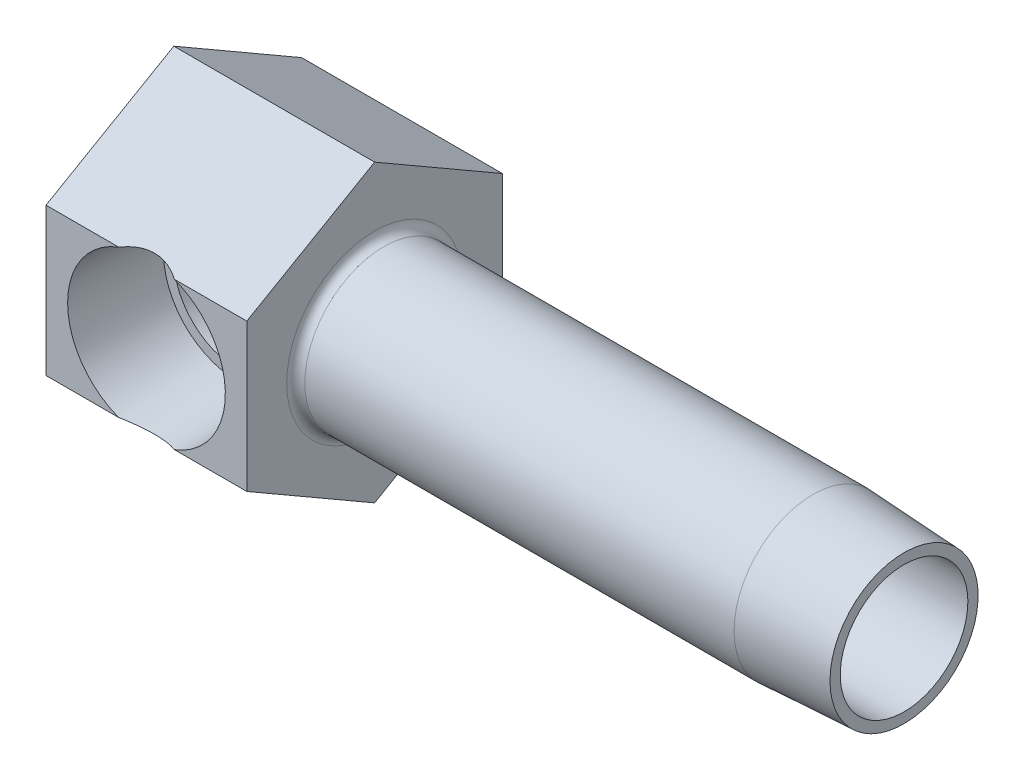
ISO-10303-21;
HEADER;
FILE_DESCRIPTION(('STEP AP214'),'2;1');
FILE_NAME('part.step','',(''),(''),'','','');
FILE_SCHEMA(('AUTOMOTIVE_DESIGN { 1 0 10303 214 1 1 1 1 }'));
ENDSEC;
DATA;
#1=APPLICATION_CONTEXT('core data for automotive mechanical design processes');
#2=APPLICATION_PROTOCOL_DEFINITION('international standard','automotive_design',2000,#1);
#3=PRODUCT_CONTEXT('',#1,'mechanical');
#4=PRODUCT('Part','Part','',(#3));
#5=PRODUCT_RELATED_PRODUCT_CATEGORY('part','',(#4));
#6=PRODUCT_DEFINITION_FORMATION('','',#4);
#7=PRODUCT_DEFINITION_CONTEXT('part definition',#1,'design');
#8=PRODUCT_DEFINITION('design','',#6,#7);
#9=PRODUCT_DEFINITION_SHAPE('','',#8);
#10=(LENGTH_UNIT() NAMED_UNIT(*) SI_UNIT(.MILLI.,.METRE.));
#11=(NAMED_UNIT(*) PLANE_ANGLE_UNIT() SI_UNIT($,.RADIAN.));
#12=(NAMED_UNIT(*) SI_UNIT($,.STERADIAN.) SOLID_ANGLE_UNIT());
#13=UNCERTAINTY_MEASURE_WITH_UNIT(LENGTH_MEASURE(1.E-05),#10,'distance_accuracy_value','');
#14=(GEOMETRIC_REPRESENTATION_CONTEXT(3) GLOBAL_UNCERTAINTY_ASSIGNED_CONTEXT((#13)) GLOBAL_UNIT_ASSIGNED_CONTEXT((#10,
#11,#12)) REPRESENTATION_CONTEXT('',''));
#15=CARTESIAN_POINT('',(0.,0.,0.));
#16=DIRECTION('',(0.,0.,1.));
#17=DIRECTION('',(1.,0.,0.));
#18=AXIS2_PLACEMENT_3D('',#15,#16,#17);
#19=CARTESIAN_POINT('',(8.7376,0.,22.225));
#20=DIRECTION('',(0.,0.,1.));
#21=DIRECTION('',(1.,0.,0.));
#22=AXIS2_PLACEMENT_3D('',#19,#20,#21);
#23=CONICAL_SURFACE('',#22,6.858,0.0523598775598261);
#24=CARTESIAN_POINT('',(8.7376,-0.680996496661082,34.5170205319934));
#25=DIRECTION('',(0.,-0.866025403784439,-0.5));
#26=DIRECTION('',(0.,-0.5,0.866025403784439));
#27=AXIS2_PLACEMENT_3D('',#24,#25,#26);
#28=ELLIPSE('',#27,15.0043949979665,7.47122554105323);
#29=CARTESIAN_POINT('',(11.1603281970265,6.4158048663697,22.225));
#30=VERTEX_POINT('',#29);
#31=CARTESIAN_POINT('',(6.3148718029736,6.4158048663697,22.225));
#32=VERTEX_POINT('',#31);
#33=EDGE_CURVE('E216',#30,#32,#28,.F.);
#34=ORIENTED_EDGE('',*,*,#33,.T.);
#35=CARTESIAN_POINT('',(8.7376,0.,22.225));
#36=DIRECTION('',(0.,0.,-1.));
#37=DIRECTION('',(-1.,0.,0.));
#38=AXIS2_PLACEMENT_3D('',#35,#36,#37);
#39=CIRCLE('',#38,6.858);
#40=CARTESIAN_POINT('',(6.31487180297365,-6.41580486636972,22.225));
#41=VERTEX_POINT('',#40);
#42=EDGE_CURVE('E38',#41,#32,#39,.T.);
#43=ORIENTED_EDGE('',*,*,#42,.F.);
#44=CARTESIAN_POINT('',(8.7376,0.680996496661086,34.5170205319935));
#45=DIRECTION('',(0.,0.866025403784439,-0.5));
#46=DIRECTION('',(0.,0.5,0.866025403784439));
#47=AXIS2_PLACEMENT_3D('',#44,#45,#46);
#48=ELLIPSE('',#47,15.0043949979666,7.47122554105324);
#49=CARTESIAN_POINT('',(11.1603281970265,-6.4158048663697,22.225));
#50=VERTEX_POINT('',#49);
#51=EDGE_CURVE('E23',#41,#50,#48,.F.);
#52=ORIENTED_EDGE('',*,*,#51,.T.);
#53=EDGE_CURVE('E220',#30,#50,#39,.T.);
#54=ORIENTED_EDGE('',*,*,#53,.F.);
#55=EDGE_LOOP('',(#34,#43,#52,#54));
#56=FACE_BOUND('',#55,.T.);
#57=CARTESIAN_POINT('',(8.7376,0.,14.3002));
#58=DIRECTION('',(0.,0.,-1.));
#59=DIRECTION('',(-1.,0.,0.));
#60=AXIS2_PLACEMENT_3D('',#57,#58,#59);
#61=CIRCLE('',#60,6.44267883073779);
#62=CARTESIAN_POINT('',(13.3057672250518,-4.54312213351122,14.3002));
#63=VERTEX_POINT('',#62);
#64=CARTESIAN_POINT('',(13.3057672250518,4.54312213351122,14.3002));
#65=VERTEX_POINT('',#64);
#66=EDGE_CURVE('E219',#63,#65,#61,.T.);
#67=ORIENTED_EDGE('',*,*,#66,.T.);
#68=CARTESIAN_POINT('',(13.3056128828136,4.54326245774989,14.3));
#69=CARTESIAN_POINT('',(13.4050037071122,4.45290836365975,14.4287190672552));
#70=CARTESIAN_POINT('',(13.5038252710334,4.35690222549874,14.5539811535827));
#71=CARTESIAN_POINT('',(13.6989301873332,4.15324987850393,14.7972290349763));
#72=CARTESIAN_POINT('',(13.7952093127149,4.04558563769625,14.9152031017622));
#73=CARTESIAN_POINT('',(13.9843700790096,3.81752411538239,15.1441485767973));
#74=CARTESIAN_POINT('',(14.0772125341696,3.69701926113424,15.25504596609));
#75=CARTESIAN_POINT('',(14.2568464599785,3.44414434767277,15.4675620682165));
#76=CARTESIAN_POINT('',(14.3436418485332,3.31178210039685,15.5691868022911));
#77=CARTESIAN_POINT('',(14.5527686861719,2.962976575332,15.8122617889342));
#78=CARTESIAN_POINT('',(14.6701286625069,2.73858307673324,15.9469651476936));
#79=CARTESIAN_POINT('',(14.8276174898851,2.38307262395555,16.1264780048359));
#80=CARTESIAN_POINT('',(14.8769849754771,2.2615363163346,16.1825173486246));
#81=CARTESIAN_POINT('',(14.9687772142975,2.0125151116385,16.2864098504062));
#82=CARTESIAN_POINT('',(15.0112056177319,1.88503338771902,16.3342673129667));
#83=CARTESIAN_POINT('',(15.088733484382,1.6232487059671,16.4215218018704));
#84=CARTESIAN_POINT('',(15.1237419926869,1.48888366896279,16.4608139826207));
#85=CARTESIAN_POINT('',(15.1849785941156,1.21573970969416,16.5294343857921));
#86=CARTESIAN_POINT('',(15.2112114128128,1.0769632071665,16.5587679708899));
#87=CARTESIAN_POINT('',(15.2542466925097,0.796159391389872,16.6068431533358));
#88=CARTESIAN_POINT('',(15.2710505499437,0.654132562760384,16.6255863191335));
#89=CARTESIAN_POINT('',(15.2947665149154,0.368243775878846,16.6520290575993));
#90=CARTESIAN_POINT('',(15.3016803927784,0.22438215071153,16.6597306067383));
#91=CARTESIAN_POINT('',(15.3051381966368,-0.0413792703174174,16.6635827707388));
#92=CARTESIAN_POINT('',(15.3031178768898,-0.163241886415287,16.6613326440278));
#93=CARTESIAN_POINT('',(15.2919140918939,-0.406265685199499,16.6488476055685));
#94=CARTESIAN_POINT('',(15.282728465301,-0.527426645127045,16.6386102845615));
#95=CARTESIAN_POINT('',(15.2573805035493,-0.768029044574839,16.6103343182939));
#96=CARTESIAN_POINT('',(15.2412218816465,-0.88747136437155,16.5922998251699));
#97=CARTESIAN_POINT('',(15.2022471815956,-1.1238947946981,16.5487418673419));
#98=CARTESIAN_POINT('',(15.1794285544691,-1.24087494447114,16.5232155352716));
#99=CARTESIAN_POINT('',(15.1030013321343,-1.58064044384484,16.4375716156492));
#100=CARTESIAN_POINT('',(15.0406598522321,-1.79907617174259,16.3675454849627));
#101=CARTESIAN_POINT('',(14.8959772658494,-2.2198653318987,16.2041288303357));
#102=CARTESIAN_POINT('',(14.8136249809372,-2.42220969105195,16.1107252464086));
#103=CARTESIAN_POINT('',(14.6581620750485,-2.75475802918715,15.9330467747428));
#104=CARTESIAN_POINT('',(14.588877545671,-2.88934500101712,15.8534887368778));
#105=CARTESIAN_POINT('',(14.4433958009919,-3.14876465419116,15.6853070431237));
#106=CARTESIAN_POINT('',(14.3671982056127,-3.27359679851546,15.5966828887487));
#107=CARTESIAN_POINT('',(14.2091096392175,-3.51355050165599,15.4112660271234));
#108=CARTESIAN_POINT('',(14.1272094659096,-3.62865566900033,15.3144600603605));
#109=CARTESIAN_POINT('',(13.9591121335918,-3.84892561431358,15.1136697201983));
#110=CARTESIAN_POINT('',(13.8729164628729,-3.95409379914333,15.0096878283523));
#111=CARTESIAN_POINT('',(13.7069469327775,-4.14374167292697,14.806812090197));
#112=CARTESIAN_POINT('',(13.62749258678,-4.22922772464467,14.7085925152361));
#113=CARTESIAN_POINT('',(13.4673498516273,-4.39212627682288,14.5076746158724));
#114=CARTESIAN_POINT('',(13.386669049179,-4.46957495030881,14.404999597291));
#115=CARTESIAN_POINT('',(13.3056128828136,-4.54326245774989,14.3));
#116=B_SPLINE_CURVE_WITH_KNOTS('',3,(#68,#69,#70,#71,#72,#73,#74,#75,#76,#77,#78,#79,#80,#81,
#82,#83,#84,#85,#86,#87,#88,#89,#90,#91,#92,#93,#94,#95,#96,#97,#98,#99,#100,#101,#102,#103,
#104,#105,#106,#107,#108,#109,#110,#111,#112,#113,#114,#115),.UNSPECIFIED.,.F.,.F.,(4,2,2,2,2,2,
2,2,2,2,2,2,2,2,2,2,2,2,2,2,2,2,2,4),(0.,0.55807217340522,1.11702021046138,1.68108674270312,
2.24478434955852,3.10140634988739,3.52893103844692,3.95623010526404,4.38849766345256,
4.82053207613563,5.25250248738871,5.68439556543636,6.04963287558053,6.41498039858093,
6.78013360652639,7.14542675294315,7.85550743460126,8.56598569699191,9.07835413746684,
9.59075076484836,10.1039943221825,10.6170612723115,11.0743952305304,11.5295724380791),.UNSPECIFIED.);
#117=EDGE_CURVE('E131',#65,#63,#116,.T.);
#118=ORIENTED_EDGE('',*,*,#117,.T.);
#119=EDGE_LOOP('',(#67,#118));
#120=FACE_BOUND('',#119,.T.);
#121=ADVANCED_FACE('F15',(#56,#120),#23,.F.);
#122=CARTESIAN_POINT('',(15.1802788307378,0.,14.3002));
#123=DIRECTION('',(0.,0.,1.));
#124=DIRECTION('',(1.,0.,0.));
#125=AXIS2_PLACEMENT_3D('',#122,#123,#124);
#126=PLANE('',#125);
#127=ORIENTED_EDGE('',*,*,#66,.F.);
#128=DIRECTION('',(1.,0.,0.));
#129=VECTOR('',#128,1.);
#130=CARTESIAN_POINT('',(65.6255637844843,-4.54312213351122,14.3002));
#131=LINE('',#130,#129);
#132=CARTESIAN_POINT('',(11.9253,-4.54312213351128,14.3002));
#133=VERTEX_POINT('',#132);
#134=EDGE_CURVE('E129',#63,#133,#131,.F.);
#135=ORIENTED_EDGE('',*,*,#134,.T.);
#136=CARTESIAN_POINT('',(8.7376,0.,14.3002));
#137=DIRECTION('',(0.,0.,-1.));
#138=DIRECTION('',(-1.,0.,0.));
#139=AXIS2_PLACEMENT_3D('',#136,#137,#138);
#140=CIRCLE('',#139,5.5499);
#141=CARTESIAN_POINT('',(11.9253,4.54312213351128,14.3002));
#142=VERTEX_POINT('',#141);
#143=EDGE_CURVE('E121',#133,#142,#140,.T.);
#144=ORIENTED_EDGE('',*,*,#143,.T.);
#145=DIRECTION('',(1.,0.,0.));
#146=VECTOR('',#145,1.);
#147=CARTESIAN_POINT('',(65.6255637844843,4.54312213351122,14.3002));
#148=LINE('',#147,#146);
#149=EDGE_CURVE('E124',#142,#65,#148,.T.);
#150=ORIENTED_EDGE('',*,*,#149,.T.);
#151=EDGE_LOOP('',(#127,#135,#144,#150));
#152=FACE_BOUND('',#151,.T.);
#153=ADVANCED_FACE('F159',(#152),#126,.T.);
#154=CARTESIAN_POINT('',(8.7376,0.,27.6280516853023));
#155=DIRECTION('',(0.,0.,-1.));
#156=DIRECTION('',(-1.,0.,0.));
#157=AXIS2_PLACEMENT_3D('',#154,#155,#156);
#158=CYLINDRICAL_SURFACE('',#157,5.5499);
#159=ORIENTED_EDGE('',*,*,#143,.F.);
#160=CARTESIAN_POINT('',(8.7376,0.,11.1125));
#161=DIRECTION('',(0.707106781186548,0.,-0.707106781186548));
#162=DIRECTION('',(-0.707106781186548,0.,-0.707106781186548));
#163=AXIS2_PLACEMENT_3D('',#160,#161,#162);
#164=ELLIPSE('',#163,7.84874384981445,5.5499);
#165=CARTESIAN_POINT('',(8.7376,-5.5499,11.1125));
#166=VERTEX_POINT('',#165);
#167=EDGE_CURVE('E110',#133,#166,#164,.T.);
#168=ORIENTED_EDGE('',*,*,#167,.T.);
#169=CARTESIAN_POINT('',(8.7376,0.,11.1125));
#170=DIRECTION('',(-0.707106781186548,0.,-0.707106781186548));
#171=DIRECTION('',(0.707106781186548,0.,-0.707106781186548));
#172=AXIS2_PLACEMENT_3D('',#169,#170,#171);
#173=ELLIPSE('',#172,7.84874384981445,5.5499);
#174=CARTESIAN_POINT('',(13.4708637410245,-2.89786203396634,6.37923625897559));
#175=VERTEX_POINT('',#174);
#176=EDGE_CURVE('E106',#166,#175,#173,.F.);
#177=ORIENTED_EDGE('',*,*,#176,.T.);
#178=CARTESIAN_POINT('',(8.7376,0.,6.37923625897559));
#179=DIRECTION('',(0.,0.,-1.));
#180=DIRECTION('',(-1.,0.,0.));
#181=AXIS2_PLACEMENT_3D('',#178,#179,#180);
#182=CIRCLE('',#181,5.5499);
#183=CARTESIAN_POINT('',(13.4708637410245,2.89786203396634,6.37923625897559));
#184=VERTEX_POINT('',#183);
#185=EDGE_CURVE('E223',#175,#184,#182,.T.);
#186=ORIENTED_EDGE('',*,*,#185,.T.);
#187=CARTESIAN_POINT('',(8.7376,5.5499,11.1125));
#188=VERTEX_POINT('',#187);
#189=EDGE_CURVE('E30',#184,#188,#173,.F.);
#190=ORIENTED_EDGE('',*,*,#189,.T.);
#191=EDGE_CURVE('E122',#188,#142,#164,.T.);
#192=ORIENTED_EDGE('',*,*,#191,.T.);
#193=EDGE_LOOP('',(#159,#168,#177,#186,#190,#192));
#194=FACE_BOUND('',#193,.T.);
#195=ADVANCED_FACE('F118',(#194),#158,.F.);
#196=CARTESIAN_POINT('',(8.7376,0.,6.37923625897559));
#197=DIRECTION('',(0.,0.,1.));
#198=DIRECTION('',(1.,0.,0.));
#199=AXIS2_PLACEMENT_3D('',#196,#197,#198);
#200=CONICAL_SURFACE('',#199,5.5499,1.04719755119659);
#201=CARTESIAN_POINT('',(8.7376,0.,3.175));
#202=VERTEX_POINT('',#201);
#203=VERTEX_LOOP('',#202);
#204=FACE_BOUND('',#203,.T.);
#205=ORIENTED_EDGE('',*,*,#185,.F.);
#206=CARTESIAN_POINT('',(13.4710699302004,-2.89818868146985,6.37943625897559));
#207=CARTESIAN_POINT('',(13.420685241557,-2.8185279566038,6.33063423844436));
#208=CARTESIAN_POINT('',(13.3737513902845,-2.73601453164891,6.2828976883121));
#209=CARTESIAN_POINT('',(13.2869939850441,-2.56583570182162,6.19038737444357));
#210=CARTESIAN_POINT('',(13.2471660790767,-2.47817349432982,6.14561180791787));
#211=CARTESIAN_POINT('',(13.1751547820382,-2.29911606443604,6.06025322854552));
#212=CARTESIAN_POINT('',(13.1428940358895,-2.20777091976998,6.01963042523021));
#213=CARTESIAN_POINT('',(13.0851463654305,-2.02119544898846,5.94274790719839));
#214=CARTESIAN_POINT('',(13.0596596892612,-1.92596498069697,5.90648835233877));
#215=CARTESIAN_POINT('',(13.0148514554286,-1.73255643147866,5.83897057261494));
#216=CARTESIAN_POINT('',(12.9955185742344,-1.63438413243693,5.80770321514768));
#217=CARTESIAN_POINT('',(12.9620830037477,-1.4356334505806,5.75050007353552));
#218=CARTESIAN_POINT('',(12.9479806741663,-1.33505490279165,5.72456465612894));
#219=CARTESIAN_POINT('',(12.9240526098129,-1.13183172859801,5.67823452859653));
#220=CARTESIAN_POINT('',(12.9142392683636,-1.0291819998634,5.65785593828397));
#221=CARTESIAN_POINT('',(12.8981074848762,-0.822623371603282,5.62290462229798));
#222=CARTESIAN_POINT('',(12.891789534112,-0.718714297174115,5.60833271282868));
#223=CARTESIAN_POINT('',(12.8810293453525,-0.489671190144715,5.58281999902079));
#224=CARTESIAN_POINT('',(12.8771967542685,-0.364365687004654,5.57314917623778));
#225=CARTESIAN_POINT('',(12.8729275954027,-0.113319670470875,5.56233429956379));
#226=CARTESIAN_POINT('',(12.8724915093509,0.0124209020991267,5.56119145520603));
#227=CARTESIAN_POINT('',(12.874939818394,0.263686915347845,5.567443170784));
#228=CARTESIAN_POINT('',(12.8778249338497,0.389212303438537,5.57483958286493));
#229=CARTESIAN_POINT('',(12.8874191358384,0.639322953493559,5.59811647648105));
#230=CARTESIAN_POINT('',(12.8941278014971,0.763908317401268,5.61399602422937));
#231=CARTESIAN_POINT('',(12.9116197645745,1.00072761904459,5.65236645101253));
#232=CARTESIAN_POINT('',(12.9220027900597,1.11310193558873,5.6741708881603));
#233=CARTESIAN_POINT('',(12.9479188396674,1.33574469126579,5.72453194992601));
#234=CARTESIAN_POINT('',(12.9634519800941,1.44601308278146,5.75308872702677));
#235=CARTESIAN_POINT('',(13.00082798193,1.66326683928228,5.81649299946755));
#236=CARTESIAN_POINT('',(13.022650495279,1.77026157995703,5.85132007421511));
#237=CARTESIAN_POINT('',(13.0737132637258,1.98033019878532,5.92673676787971));
#238=CARTESIAN_POINT('',(13.1029503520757,2.08340572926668,5.96732392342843));
#239=CARTESIAN_POINT('',(13.1785970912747,2.31167706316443,6.06504898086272));
#240=CARTESIAN_POINT('',(13.2275080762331,2.43541928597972,6.12371071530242));
#241=CARTESIAN_POINT('',(13.3111431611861,2.61414296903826,6.21635789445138));
#242=CARTESIAN_POINT('',(13.3408272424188,2.67271819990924,6.24810824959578));
#243=CARTESIAN_POINT('',(13.4034989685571,2.78735967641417,6.31288069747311));
#244=CARTESIAN_POINT('',(13.4364871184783,2.8434255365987,6.34590298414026));
#245=CARTESIAN_POINT('',(13.4710699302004,2.89818868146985,6.37943625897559));
#246=B_SPLINE_CURVE_WITH_KNOTS('',3,(#206,#207,#208,#209,#210,#211,#212,#213,#214,#215,#216,
#217,#218,#219,#220,#221,#222,#223,#224,#225,#226,#227,#228,#229,#230,#231,#232,#233,#234,#235,
#236,#237,#238,#239,#240,#241,#242,#243,#244,#245),.UNSPECIFIED.,.F.,.F.,(4,2,2,2,2,2,2,2,2,2,2,
2,2,2,2,2,2,2,2,4),(0.,0.318348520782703,0.636501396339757,0.951244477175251,1.26599908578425,
1.58017112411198,1.89436476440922,2.20946038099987,2.52460027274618,2.90145665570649,
3.27836648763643,3.65535808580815,4.03230819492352,4.37682355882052,4.72134670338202,
5.06476748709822,5.40804184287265,5.84309066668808,6.06180090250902,6.28054461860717),.UNSPECIFIED.);
#247=EDGE_CURVE('E112',#175,#184,#246,.T.);
#248=ORIENTED_EDGE('',*,*,#247,.T.);
#249=EDGE_LOOP('',(#205,#248));
#250=FACE_BOUND('',#249,.T.);
#251=ADVANCED_FACE('F151',(#204,#250),#200,.F.);
#252=CARTESIAN_POINT('',(63.5,0.,11.1125));
#253=DIRECTION('',(-1.,0.,0.));
#254=DIRECTION('',(0.,0.,1.));
#255=AXIS2_PLACEMENT_3D('',#252,#253,#254);
#256=PLANE('',#255);
#257=CARTESIAN_POINT('',(63.5,0.,11.1125));
#258=DIRECTION('',(-1.,0.,0.));
#259=DIRECTION('',(0.,0.,1.));
#260=AXIS2_PLACEMENT_3D('',#257,#258,#259);
#261=CIRCLE('',#260,6.44267883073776);
#262=CARTESIAN_POINT('',(63.5,0.,17.5551788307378));
#263=VERTEX_POINT('',#262);
#264=EDGE_CURVE('E10',#263,#263,#261,.F.);
#265=ORIENTED_EDGE('',*,*,#264,.T.);
#266=EDGE_LOOP('',(#265));
#267=FACE_BOUND('',#266,.T.);
#268=CARTESIAN_POINT('',(63.5,0.,11.1125));
#269=DIRECTION('',(1.,0.,0.));
#270=DIRECTION('',(0.,0.,-1.));
#271=AXIS2_PLACEMENT_3D('',#268,#269,#270);
#272=CIRCLE('',#271,5.5499);
#273=CARTESIAN_POINT('',(63.5,0.,5.5626));
#274=VERTEX_POINT('',#273);
#275=EDGE_CURVE('E150',#274,#274,#272,.T.);
#276=ORIENTED_EDGE('',*,*,#275,.F.);
#277=EDGE_LOOP('',(#276));
#278=FACE_BOUND('',#277,.T.);
#279=ADVANCED_FACE('F155',(#267,#278),#256,.F.);
#280=CARTESIAN_POINT('',(17.4625,12.8316097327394,11.1125));
#281=DIRECTION('',(0.,-0.866025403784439,-0.5));
#282=DIRECTION('',(0.,0.5,-0.866025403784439));
#283=AXIS2_PLACEMENT_3D('',#280,#281,#282);
#284=PLANE('',#283);
#285=ORIENTED_EDGE('',*,*,#33,.F.);
#286=DIRECTION('',(-1.,0.,0.));
#287=VECTOR('',#286,1.);
#288=CARTESIAN_POINT('',(17.4625,6.4158048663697,22.225));
#289=LINE('',#288,#287);
#290=CARTESIAN_POINT('',(17.4625,6.4158048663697,22.225));
#291=VERTEX_POINT('',#290);
#292=EDGE_CURVE('E268',#291,#30,#289,.T.);
#293=ORIENTED_EDGE('',*,*,#292,.F.);
#294=DIRECTION('',(0.,-0.5,0.866025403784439));
#295=VECTOR('',#294,1.);
#296=CARTESIAN_POINT('',(17.4625,12.8316097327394,11.1125));
#297=LINE('',#296,#295);
#298=CARTESIAN_POINT('',(17.4625,12.8316097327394,11.1125));
#299=VERTEX_POINT('',#298);
#300=EDGE_CURVE('E252',#299,#291,#297,.T.);
#301=ORIENTED_EDGE('',*,*,#300,.F.);
#302=DIRECTION('',(-1.,0.,0.));
#303=VECTOR('',#302,1.);
#304=CARTESIAN_POINT('',(17.4625,12.8316097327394,11.1125));
#305=LINE('',#304,#303);
#306=CARTESIAN_POINT('',(0.,12.8316097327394,11.1125));
#307=VERTEX_POINT('',#306);
#308=EDGE_CURVE('E271',#299,#307,#305,.T.);
#309=ORIENTED_EDGE('',*,*,#308,.T.);
#310=DIRECTION('',(0.,-0.5,0.866025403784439));
#311=VECTOR('',#310,1.);
#312=CARTESIAN_POINT('',(0.,12.8316097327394,11.1125));
#313=LINE('',#312,#311);
#314=CARTESIAN_POINT('',(0.,6.4158048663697,22.225));
#315=VERTEX_POINT('',#314);
#316=EDGE_CURVE('E234',#307,#315,#313,.T.);
#317=ORIENTED_EDGE('',*,*,#316,.T.);
#318=EDGE_CURVE('E267',#32,#315,#289,.T.);
#319=ORIENTED_EDGE('',*,*,#318,.F.);
#320=EDGE_LOOP('',(#285,#293,#301,#309,#317,#319));
#321=FACE_BOUND('',#320,.T.);
#322=ADVANCED_FACE('F170',(#321),#284,.F.);
#323=CARTESIAN_POINT('',(17.4625,6.4158048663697,22.225));
#324=DIRECTION('',(0.,0.,-1.));
#325=DIRECTION('',(0.,1.,0.));
#326=AXIS2_PLACEMENT_3D('',#323,#324,#325);
#327=PLANE('',#326);
#328=ORIENTED_EDGE('',*,*,#42,.T.);
#329=ORIENTED_EDGE('',*,*,#318,.T.);
#330=DIRECTION('',(0.,-1.,0.));
#331=VECTOR('',#330,1.);
#332=CARTESIAN_POINT('',(0.,6.4158048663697,22.225));
#333=LINE('',#332,#331);
#334=CARTESIAN_POINT('',(0.,-6.41580486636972,22.225));
#335=VERTEX_POINT('',#334);
#336=EDGE_CURVE('E238',#315,#335,#333,.T.);
#337=ORIENTED_EDGE('',*,*,#336,.T.);
#338=DIRECTION('',(-1.,0.,0.));
#339=VECTOR('',#338,1.);
#340=CARTESIAN_POINT('',(17.4625,-6.41580486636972,22.225));
#341=LINE('',#340,#339);
#342=EDGE_CURVE('E263',#41,#335,#341,.T.);
#343=ORIENTED_EDGE('',*,*,#342,.F.);
#344=EDGE_LOOP('',(#328,#329,#337,#343));
#345=FACE_BOUND('',#344,.T.);
#346=ADVANCED_FACE('F190',(#345),#327,.F.);
#347=ORIENTED_EDGE('',*,*,#53,.T.);
#348=CARTESIAN_POINT('',(17.4625,-6.41580486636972,22.225));
#349=VERTEX_POINT('',#348);
#350=EDGE_CURVE('E264',#349,#50,#341,.T.);
#351=ORIENTED_EDGE('',*,*,#350,.F.);
#352=DIRECTION('',(0.,-1.,0.));
#353=VECTOR('',#352,1.);
#354=CARTESIAN_POINT('',(17.4625,6.4158048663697,22.225));
#355=LINE('',#354,#353);
#356=EDGE_CURVE('E254',#291,#349,#355,.T.);
#357=ORIENTED_EDGE('',*,*,#356,.F.);
#358=ORIENTED_EDGE('',*,*,#292,.T.);
#359=EDGE_LOOP('',(#347,#351,#357,#358));
#360=FACE_BOUND('',#359,.T.);
#361=ADVANCED_FACE('F188',(#360),#327,.F.);
#362=CARTESIAN_POINT('',(17.4625,-6.41580486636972,22.225));
#363=DIRECTION('',(0.,0.866025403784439,-0.5));
#364=DIRECTION('',(0.,0.5,0.866025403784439));
#365=AXIS2_PLACEMENT_3D('',#362,#363,#364);
#366=PLANE('',#365);
#367=ORIENTED_EDGE('',*,*,#51,.F.);
#368=ORIENTED_EDGE('',*,*,#342,.T.);
#369=DIRECTION('',(0.,-0.5,-0.866025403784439));
#370=VECTOR('',#369,1.);
#371=CARTESIAN_POINT('',(0.,-6.41580486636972,22.225));
#372=LINE('',#371,#370);
#373=CARTESIAN_POINT('',(0.,-12.8316097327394,11.1125));
#374=VERTEX_POINT('',#373);
#375=EDGE_CURVE('E242',#335,#374,#372,.T.);
#376=ORIENTED_EDGE('',*,*,#375,.T.);
#377=DIRECTION('',(-1.,0.,0.));
#378=VECTOR('',#377,1.);
#379=CARTESIAN_POINT('',(17.4625,-12.8316097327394,11.1125));
#380=LINE('',#379,#378);
#381=CARTESIAN_POINT('',(17.4625,-12.8316097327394,11.1125));
#382=VERTEX_POINT('',#381);
#383=EDGE_CURVE('E258',#382,#374,#380,.T.);
#384=ORIENTED_EDGE('',*,*,#383,.F.);
#385=DIRECTION('',(0.,-0.5,-0.866025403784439));
#386=VECTOR('',#385,1.);
#387=CARTESIAN_POINT('',(17.4625,-6.41580486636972,22.225));
#388=LINE('',#387,#386);
#389=EDGE_CURVE('E256',#349,#382,#388,.T.);
#390=ORIENTED_EDGE('',*,*,#389,.F.);
#391=ORIENTED_EDGE('',*,*,#350,.T.);
#392=EDGE_LOOP('',(#367,#368,#376,#384,#390,#391));
#393=FACE_BOUND('',#392,.T.);
#394=ADVANCED_FACE('F184',(#393),#366,.F.);
#395=CARTESIAN_POINT('',(17.4625,-12.8316097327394,11.1125));
#396=DIRECTION('',(0.,0.866025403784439,0.5));
#397=DIRECTION('',(0.,-0.5,0.866025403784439));
#398=AXIS2_PLACEMENT_3D('',#395,#396,#397);
#399=PLANE('',#398);
#400=DIRECTION('',(0.,0.5,-0.866025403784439));
#401=VECTOR('',#400,1.);
#402=CARTESIAN_POINT('',(0.,-12.8316097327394,11.1125));
#403=LINE('',#402,#401);
#404=CARTESIAN_POINT('',(0.,-6.41580486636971,0.));
#405=VERTEX_POINT('',#404);
#406=EDGE_CURVE('E227',#374,#405,#403,.T.);
#407=ORIENTED_EDGE('',*,*,#406,.T.);
#408=DIRECTION('',(-1.,0.,0.));
#409=VECTOR('',#408,1.);
#410=CARTESIAN_POINT('',(17.4625,-6.41580486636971,0.));
#411=LINE('',#410,#409);
#412=CARTESIAN_POINT('',(17.4625,-6.41580486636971,0.));
#413=VERTEX_POINT('',#412);
#414=EDGE_CURVE('E277',#413,#405,#411,.T.);
#415=ORIENTED_EDGE('',*,*,#414,.F.);
#416=DIRECTION('',(0.,0.5,-0.866025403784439));
#417=VECTOR('',#416,1.);
#418=CARTESIAN_POINT('',(17.4625,-12.8316097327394,11.1125));
#419=LINE('',#418,#417);
#420=EDGE_CURVE('E245',#382,#413,#419,.T.);
#421=ORIENTED_EDGE('',*,*,#420,.F.);
#422=ORIENTED_EDGE('',*,*,#383,.T.);
#423=EDGE_LOOP('',(#407,#415,#421,#422));
#424=FACE_BOUND('',#423,.T.);
#425=ADVANCED_FACE('F187',(#424),#399,.F.);
#426=CARTESIAN_POINT('',(17.4625,-6.41580486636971,0.));
#427=DIRECTION('',(0.,0.,1.));
#428=DIRECTION('',(1.,0.,0.));
#429=AXIS2_PLACEMENT_3D('',#426,#427,#428);
#430=PLANE('',#429);
#431=DIRECTION('',(0.,1.,0.));
#432=VECTOR('',#431,1.);
#433=CARTESIAN_POINT('',(0.,-6.41580486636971,0.));
#434=LINE('',#433,#432);
#435=CARTESIAN_POINT('',(0.,6.41580486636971,0.));
#436=VERTEX_POINT('',#435);
#437=EDGE_CURVE('E228',#405,#436,#434,.T.);
#438=ORIENTED_EDGE('',*,*,#437,.T.);
#439=DIRECTION('',(-1.,0.,0.));
#440=VECTOR('',#439,1.);
#441=CARTESIAN_POINT('',(17.4625,6.41580486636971,0.));
#442=LINE('',#441,#440);
#443=CARTESIAN_POINT('',(17.4625,6.41580486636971,0.));
#444=VERTEX_POINT('',#443);
#445=EDGE_CURVE('E274',#444,#436,#442,.T.);
#446=ORIENTED_EDGE('',*,*,#445,.F.);
#447=DIRECTION('',(0.,1.,0.));
#448=VECTOR('',#447,1.);
#449=CARTESIAN_POINT('',(17.4625,-6.41580486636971,0.));
#450=LINE('',#449,#448);
#451=EDGE_CURVE('E248',#413,#444,#450,.T.);
#452=ORIENTED_EDGE('',*,*,#451,.F.);
#453=ORIENTED_EDGE('',*,*,#414,.T.);
#454=EDGE_LOOP('',(#438,#446,#452,#453));
#455=FACE_BOUND('',#454,.T.);
#456=ADVANCED_FACE('F199',(#455),#430,.F.);
#457=CARTESIAN_POINT('',(17.4625,6.4158048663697,0.));
#458=DIRECTION('',(0.,-0.866025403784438,0.5));
#459=DIRECTION('',(0.,-0.5,-0.866025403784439));
#460=AXIS2_PLACEMENT_3D('',#457,#458,#459);
#461=PLANE('',#460);
#462=DIRECTION('',(0.,0.5,0.866025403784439));
#463=VECTOR('',#462,1.);
#464=CARTESIAN_POINT('',(0.,6.4158048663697,0.));
#465=LINE('',#464,#463);
#466=EDGE_CURVE('E231',#436,#307,#465,.T.);
#467=ORIENTED_EDGE('',*,*,#466,.T.);
#468=ORIENTED_EDGE('',*,*,#308,.F.);
#469=DIRECTION('',(0.,0.5,0.866025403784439));
#470=VECTOR('',#469,1.);
#471=CARTESIAN_POINT('',(17.4625,6.4158048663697,0.));
#472=LINE('',#471,#470);
#473=EDGE_CURVE('E250',#444,#299,#472,.T.);
#474=ORIENTED_EDGE('',*,*,#473,.F.);
#475=ORIENTED_EDGE('',*,*,#445,.T.);
#476=EDGE_LOOP('',(#467,#468,#474,#475));
#477=FACE_BOUND('',#476,.T.);
#478=ADVANCED_FACE('F182',(#477),#461,.F.);
#479=CARTESIAN_POINT('',(17.4625,-19.2474145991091,22.225));
#480=DIRECTION('',(-1.,0.,0.));
#481=DIRECTION('',(0.,-1.,0.));
#482=AXIS2_PLACEMENT_3D('',#479,#480,#481);
#483=PLANE('',#482);
#484=CARTESIAN_POINT('',(17.4625,0.,11.1125));
#485=DIRECTION('',(-1.,0.,0.));
#486=DIRECTION('',(0.,-1.,0.));
#487=AXIS2_PLACEMENT_3D('',#484,#485,#486);
#488=CIRCLE('',#487,7.6454);
#489=CARTESIAN_POINT('',(17.4625,-7.6454,11.1125));
#490=VERTEX_POINT('',#489);
#491=EDGE_CURVE('E280',#490,#490,#488,.T.);
#492=ORIENTED_EDGE('',*,*,#491,.T.);
#493=EDGE_LOOP('',(#492));
#494=FACE_BOUND('',#493,.T.);
#495=ORIENTED_EDGE('',*,*,#420,.T.);
#496=ORIENTED_EDGE('',*,*,#451,.T.);
#497=ORIENTED_EDGE('',*,*,#473,.T.);
#498=ORIENTED_EDGE('',*,*,#300,.T.);
#499=ORIENTED_EDGE('',*,*,#356,.T.);
#500=ORIENTED_EDGE('',*,*,#389,.T.);
#501=EDGE_LOOP('',(#495,#496,#497,#498,#499,#500));
#502=FACE_BOUND('',#501,.T.);
#503=ADVANCED_FACE('F178',(#494,#502),#483,.F.);
#504=CARTESIAN_POINT('',(0.,-19.2474145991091,22.225));
#505=DIRECTION('',(-1.,0.,0.));
#506=DIRECTION('',(0.,-1.,0.));
#507=AXIS2_PLACEMENT_3D('',#504,#505,#506);
#508=PLANE('',#507);
#509=ORIENTED_EDGE('',*,*,#406,.F.);
#510=ORIENTED_EDGE('',*,*,#375,.F.);
#511=ORIENTED_EDGE('',*,*,#336,.F.);
#512=ORIENTED_EDGE('',*,*,#316,.F.);
#513=ORIENTED_EDGE('',*,*,#466,.F.);
#514=ORIENTED_EDGE('',*,*,#437,.F.);
#515=EDGE_LOOP('',(#509,#510,#511,#512,#513,#514));
#516=FACE_BOUND('',#515,.T.);
#517=ADVANCED_FACE('F174',(#516),#508,.T.);
#518=CARTESIAN_POINT('',(63.5,0.,11.1125));
#519=DIRECTION('',(-1.,0.,0.));
#520=DIRECTION('',(0.,0.,1.));
#521=AXIS2_PLACEMENT_3D('',#518,#519,#520);
#522=CYLINDRICAL_SURFACE('',#521,6.858);
#523=CARTESIAN_POINT('',(55.5752,0.,11.1125));
#524=DIRECTION('',(-1.,0.,0.));
#525=DIRECTION('',(0.,0.,1.));
#526=AXIS2_PLACEMENT_3D('',#523,#524,#525);
#527=CIRCLE('',#526,6.858);
#528=CARTESIAN_POINT('',(55.5752,0.,17.9705));
#529=VERTEX_POINT('',#528);
#530=EDGE_CURVE('E137',#529,#529,#527,.F.);
#531=ORIENTED_EDGE('',*,*,#530,.F.);
#532=EDGE_LOOP('',(#531));
#533=FACE_BOUND('',#532,.T.);
#534=CARTESIAN_POINT('',(18.2499,0.,11.1125));
#535=DIRECTION('',(-1.,0.,0.));
#536=DIRECTION('',(0.,-1.,0.));
#537=AXIS2_PLACEMENT_3D('',#534,#535,#536);
#538=CIRCLE('',#537,6.858);
#539=CARTESIAN_POINT('',(18.2499,-6.858,11.1125));
#540=VERTEX_POINT('',#539);
#541=EDGE_CURVE('E283',#540,#540,#538,.F.);
#542=ORIENTED_EDGE('',*,*,#541,.T.);
#543=EDGE_LOOP('',(#542));
#544=FACE_BOUND('',#543,.T.);
#545=ADVANCED_FACE('F166',(#533,#544),#522,.T.);
#546=CARTESIAN_POINT('',(18.2499,0.,11.1125));
#547=DIRECTION('',(-1.,0.,0.));
#548=DIRECTION('',(0.,-1.,0.));
#549=AXIS2_PLACEMENT_3D('',#546,#547,#548);
#550=TOROIDAL_SURFACE('',#549,7.6454,0.7874);
#551=ORIENTED_EDGE('',*,*,#541,.F.);
#552=EDGE_LOOP('',(#551));
#553=FACE_BOUND('',#552,.T.);
#554=ORIENTED_EDGE('',*,*,#491,.F.);
#555=EDGE_LOOP('',(#554));
#556=FACE_BOUND('',#555,.T.);
#557=ADVANCED_FACE('F163',(#553,#556),#550,.F.);
#558=CARTESIAN_POINT('',(63.5029494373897,0.,11.1125));
#559=DIRECTION('',(-1.,0.,0.));
#560=DIRECTION('',(0.,0.,1.));
#561=AXIS2_PLACEMENT_3D('',#558,#559,#560);
#562=CONICAL_SURFACE('',#561,6.44252425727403,0.0523598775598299);
#563=ORIENTED_EDGE('',*,*,#530,.T.);
#564=EDGE_LOOP('',(#563));
#565=FACE_BOUND('',#564,.T.);
#566=ORIENTED_EDGE('',*,*,#264,.F.);
#567=EDGE_LOOP('',(#566));
#568=FACE_BOUND('',#567,.T.);
#569=ADVANCED_FACE('F142',(#565,#568),#562,.T.);
#570=CARTESIAN_POINT('',(65.6255637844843,0.,11.1125));
#571=DIRECTION('',(1.,0.,0.));
#572=DIRECTION('',(0.,0.,-1.));
#573=AXIS2_PLACEMENT_3D('',#570,#571,#572);
#574=CYLINDRICAL_SURFACE('',#573,5.5499);
#575=ORIENTED_EDGE('',*,*,#275,.T.);
#576=EDGE_LOOP('',(#575));
#577=FACE_BOUND('',#576,.T.);
#578=ORIENTED_EDGE('',*,*,#149,.F.);
#579=ORIENTED_EDGE('',*,*,#191,.F.);
#580=ORIENTED_EDGE('',*,*,#189,.F.);
#581=ORIENTED_EDGE('',*,*,#247,.F.);
#582=ORIENTED_EDGE('',*,*,#176,.F.);
#583=ORIENTED_EDGE('',*,*,#167,.F.);
#584=ORIENTED_EDGE('',*,*,#134,.F.);
#585=ORIENTED_EDGE('',*,*,#117,.F.);
#586=EDGE_LOOP('',(#578,#579,#580,#581,#582,#583,#584,#585));
#587=FACE_BOUND('',#586,.T.);
#588=ADVANCED_FACE('F108',(#577,#587),#574,.F.);
#589=CLOSED_SHELL('',(#121,#153,#195,#251,#279,#322,#346,#361,#394,#425,#456,#478,#503,#517,
#545,#557,#569,#588));
#590=MANIFOLD_SOLID_BREP('B1',#589);
#591=ADVANCED_BREP_SHAPE_REPRESENTATION('',(#18,#590),#14);
#592=SHAPE_DEFINITION_REPRESENTATION(#9,#591);
ENDSEC;
END-ISO-10303-21;
